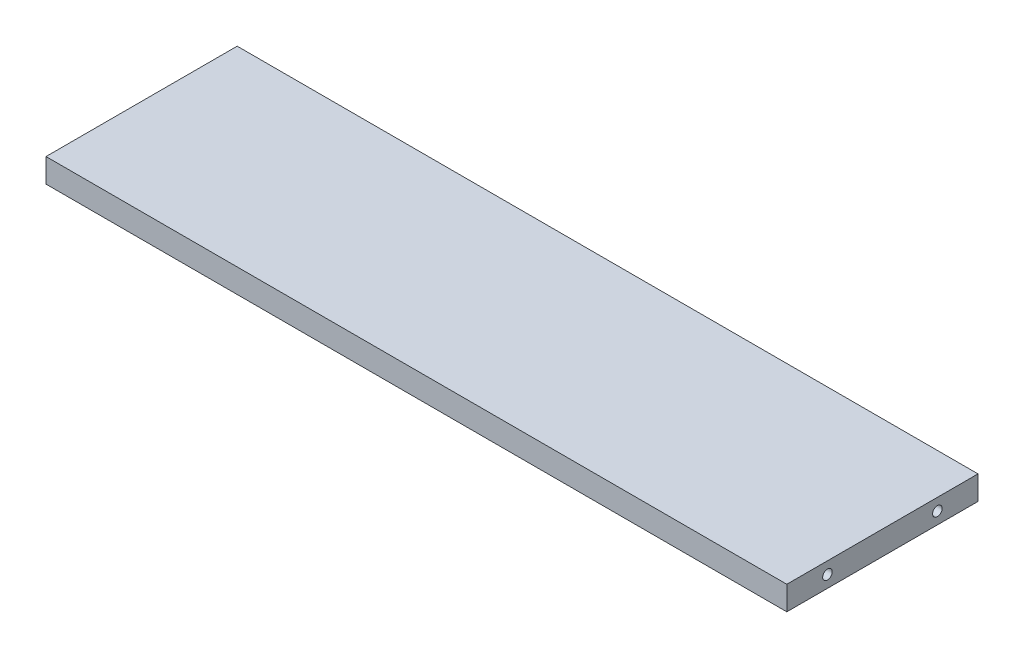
ISO-10303-21;
HEADER;
FILE_DESCRIPTION(('STEP AP214'),'2;1');
FILE_NAME('part.step','',(''),(''),'','','');
FILE_SCHEMA(('AUTOMOTIVE_DESIGN { 1 0 10303 214 1 1 1 1 }'));
ENDSEC;
DATA;
#1=APPLICATION_CONTEXT('core data for automotive mechanical design processes');
#2=APPLICATION_PROTOCOL_DEFINITION('international standard','automotive_design',2000,#1);
#3=PRODUCT_CONTEXT('',#1,'mechanical');
#4=PRODUCT('Part','Part','',(#3));
#5=PRODUCT_RELATED_PRODUCT_CATEGORY('part','',(#4));
#6=PRODUCT_DEFINITION_FORMATION('','',#4);
#7=PRODUCT_DEFINITION_CONTEXT('part definition',#1,'design');
#8=PRODUCT_DEFINITION('design','',#6,#7);
#9=PRODUCT_DEFINITION_SHAPE('','',#8);
#10=(LENGTH_UNIT() NAMED_UNIT(*) SI_UNIT(.MILLI.,.METRE.));
#11=(NAMED_UNIT(*) PLANE_ANGLE_UNIT() SI_UNIT($,.RADIAN.));
#12=(NAMED_UNIT(*) SI_UNIT($,.STERADIAN.) SOLID_ANGLE_UNIT());
#13=UNCERTAINTY_MEASURE_WITH_UNIT(LENGTH_MEASURE(1.E-05),#10,'distance_accuracy_value','');
#14=(GEOMETRIC_REPRESENTATION_CONTEXT(3) GLOBAL_UNCERTAINTY_ASSIGNED_CONTEXT((#13)) GLOBAL_UNIT_ASSIGNED_CONTEXT((#10,
#11,#12)) REPRESENTATION_CONTEXT('',''));
#15=CARTESIAN_POINT('',(0.,0.,0.));
#16=DIRECTION('',(0.,0.,1.));
#17=DIRECTION('',(1.,0.,0.));
#18=AXIS2_PLACEMENT_3D('',#15,#16,#17);
#19=CARTESIAN_POINT('',(0.,0.,-80.));
#20=DIRECTION('',(-1.,0.,0.));
#21=DIRECTION('',(0.,0.,1.));
#22=AXIS2_PLACEMENT_3D('',#19,#20,#21);
#23=PLANE('',#22);
#24=CARTESIAN_POINT('',(0.,5.,-17.));
#25=DIRECTION('',(-1.,0.,0.));
#26=DIRECTION('',(0.,0.,-1.));
#27=AXIS2_PLACEMENT_3D('',#24,#25,#26);
#28=CIRCLE('',#27,2.);
#29=CARTESIAN_POINT('',(0.,5.,-19.));
#30=VERTEX_POINT('',#29);
#31=EDGE_CURVE('E130',#30,#30,#28,.T.);
#32=ORIENTED_EDGE('',*,*,#31,.F.);
#33=EDGE_LOOP('',(#32));
#34=FACE_BOUND('',#33,.T.);
#35=CARTESIAN_POINT('',(0.,5.,-63.));
#36=DIRECTION('',(-1.,0.,0.));
#37=DIRECTION('',(0.,0.,1.));
#38=AXIS2_PLACEMENT_3D('',#35,#36,#37);
#39=CIRCLE('',#38,2.);
#40=CARTESIAN_POINT('',(0.,5.,-61.));
#41=VERTEX_POINT('',#40);
#42=EDGE_CURVE('E133',#41,#41,#39,.T.);
#43=ORIENTED_EDGE('',*,*,#42,.F.);
#44=EDGE_LOOP('',(#43));
#45=FACE_BOUND('',#44,.T.);
#46=DIRECTION('',(0.,-1.,0.));
#47=VECTOR('',#46,1.);
#48=CARTESIAN_POINT('',(0.,0.,0.));
#49=LINE('',#48,#47);
#50=CARTESIAN_POINT('',(0.,10.,0.));
#51=VERTEX_POINT('',#50);
#52=CARTESIAN_POINT('',(0.,0.,0.));
#53=VERTEX_POINT('',#52);
#54=EDGE_CURVE('E71',#51,#53,#49,.T.);
#55=ORIENTED_EDGE('',*,*,#54,.F.);
#56=DIRECTION('',(0.,0.,1.));
#57=VECTOR('',#56,1.);
#58=CARTESIAN_POINT('',(0.,10.,-80.));
#59=LINE('',#58,#57);
#60=CARTESIAN_POINT('',(0.,10.,-80.));
#61=VERTEX_POINT('',#60);
#62=EDGE_CURVE('E11',#61,#51,#59,.T.);
#63=ORIENTED_EDGE('',*,*,#62,.F.);
#64=DIRECTION('',(0.,-1.,0.));
#65=VECTOR('',#64,1.);
#66=CARTESIAN_POINT('',(0.,0.,-80.));
#67=LINE('',#66,#65);
#68=CARTESIAN_POINT('',(0.,0.,-80.));
#69=VERTEX_POINT('',#68);
#70=EDGE_CURVE('E73',#61,#69,#67,.T.);
#71=ORIENTED_EDGE('',*,*,#70,.T.);
#72=DIRECTION('',(0.,0.,1.));
#73=VECTOR('',#72,1.);
#74=CARTESIAN_POINT('',(0.,0.,-80.));
#75=LINE('',#74,#73);
#76=EDGE_CURVE('E34',#69,#53,#75,.T.);
#77=ORIENTED_EDGE('',*,*,#76,.T.);
#78=EDGE_LOOP('',(#55,#63,#71,#77));
#79=FACE_BOUND('',#78,.T.);
#80=ADVANCED_FACE('F31',(#34,#45,#79),#23,.T.);
#81=CARTESIAN_POINT('',(0.,10.,-80.));
#82=DIRECTION('',(0.,1.,0.));
#83=DIRECTION('',(0.,0.,1.));
#84=AXIS2_PLACEMENT_3D('',#81,#82,#83);
#85=PLANE('',#84);
#86=DIRECTION('',(-1.,0.,0.));
#87=VECTOR('',#86,1.);
#88=CARTESIAN_POINT('',(0.,10.,0.));
#89=LINE('',#88,#87);
#90=CARTESIAN_POINT('',(310.,10.,0.));
#91=VERTEX_POINT('',#90);
#92=EDGE_CURVE('E88',#91,#51,#89,.T.);
#93=ORIENTED_EDGE('',*,*,#92,.F.);
#94=DIRECTION('',(0.,0.,1.));
#95=VECTOR('',#94,1.);
#96=CARTESIAN_POINT('',(310.,10.,-80.));
#97=LINE('',#96,#95);
#98=CARTESIAN_POINT('',(310.,10.,-80.));
#99=VERTEX_POINT('',#98);
#100=EDGE_CURVE('E39',#99,#91,#97,.T.);
#101=ORIENTED_EDGE('',*,*,#100,.F.);
#102=DIRECTION('',(-1.,0.,0.));
#103=VECTOR('',#102,1.);
#104=CARTESIAN_POINT('',(0.,10.,-80.));
#105=LINE('',#104,#103);
#106=EDGE_CURVE('E78',#99,#61,#105,.T.);
#107=ORIENTED_EDGE('',*,*,#106,.T.);
#108=ORIENTED_EDGE('',*,*,#62,.T.);
#109=EDGE_LOOP('',(#93,#101,#107,#108));
#110=FACE_BOUND('',#109,.T.);
#111=ADVANCED_FACE('F108',(#110),#85,.T.);
#112=CARTESIAN_POINT('',(310.,0.,-80.));
#113=DIRECTION('',(1.,0.,0.));
#114=DIRECTION('',(0.,0.,-1.));
#115=AXIS2_PLACEMENT_3D('',#112,#113,#114);
#116=PLANE('',#115);
#117=CARTESIAN_POINT('',(310.,5.,-63.));
#118=DIRECTION('',(1.,0.,0.));
#119=DIRECTION('',(0.,0.,1.));
#120=AXIS2_PLACEMENT_3D('',#117,#118,#119);
#121=CIRCLE('',#120,2.);
#122=CARTESIAN_POINT('',(310.,5.,-61.));
#123=VERTEX_POINT('',#122);
#124=EDGE_CURVE('E139',#123,#123,#121,.T.);
#125=ORIENTED_EDGE('',*,*,#124,.F.);
#126=EDGE_LOOP('',(#125));
#127=FACE_BOUND('',#126,.T.);
#128=CARTESIAN_POINT('',(310.,5.,-17.));
#129=DIRECTION('',(1.,0.,0.));
#130=DIRECTION('',(0.,0.,-1.));
#131=AXIS2_PLACEMENT_3D('',#128,#129,#130);
#132=CIRCLE('',#131,2.);
#133=CARTESIAN_POINT('',(310.,5.,-19.));
#134=VERTEX_POINT('',#133);
#135=EDGE_CURVE('E92',#134,#134,#132,.T.);
#136=ORIENTED_EDGE('',*,*,#135,.F.);
#137=EDGE_LOOP('',(#136));
#138=FACE_BOUND('',#137,.T.);
#139=DIRECTION('',(0.,1.,0.));
#140=VECTOR('',#139,1.);
#141=CARTESIAN_POINT('',(310.,0.,0.));
#142=LINE('',#141,#140);
#143=CARTESIAN_POINT('',(310.,0.,0.));
#144=VERTEX_POINT('',#143);
#145=EDGE_CURVE('E85',#144,#91,#142,.T.);
#146=ORIENTED_EDGE('',*,*,#145,.F.);
#147=DIRECTION('',(0.,0.,1.));
#148=VECTOR('',#147,1.);
#149=CARTESIAN_POINT('',(310.,0.,-80.));
#150=LINE('',#149,#148);
#151=CARTESIAN_POINT('',(310.,0.,-80.));
#152=VERTEX_POINT('',#151);
#153=EDGE_CURVE('E77',#152,#144,#150,.T.);
#154=ORIENTED_EDGE('',*,*,#153,.F.);
#155=DIRECTION('',(0.,1.,0.));
#156=VECTOR('',#155,1.);
#157=CARTESIAN_POINT('',(310.,0.,-80.));
#158=LINE('',#157,#156);
#159=EDGE_CURVE('E101',#152,#99,#158,.T.);
#160=ORIENTED_EDGE('',*,*,#159,.T.);
#161=ORIENTED_EDGE('',*,*,#100,.T.);
#162=EDGE_LOOP('',(#146,#154,#160,#161));
#163=FACE_BOUND('',#162,.T.);
#164=ADVANCED_FACE('F105',(#127,#138,#163),#116,.T.);
#165=CARTESIAN_POINT('',(0.,0.,-80.));
#166=DIRECTION('',(0.,-1.,0.));
#167=DIRECTION('',(0.,0.,-1.));
#168=AXIS2_PLACEMENT_3D('',#165,#166,#167);
#169=PLANE('',#168);
#170=DIRECTION('',(1.,0.,0.));
#171=VECTOR('',#170,1.);
#172=CARTESIAN_POINT('',(0.,0.,0.));
#173=LINE('',#172,#171);
#174=EDGE_CURVE('E80',#53,#144,#173,.T.);
#175=ORIENTED_EDGE('',*,*,#174,.F.);
#176=ORIENTED_EDGE('',*,*,#76,.F.);
#177=DIRECTION('',(1.,0.,0.));
#178=VECTOR('',#177,1.);
#179=CARTESIAN_POINT('',(0.,0.,-80.));
#180=LINE('',#179,#178);
#181=EDGE_CURVE('E99',#69,#152,#180,.T.);
#182=ORIENTED_EDGE('',*,*,#181,.T.);
#183=ORIENTED_EDGE('',*,*,#153,.T.);
#184=EDGE_LOOP('',(#175,#176,#182,#183));
#185=FACE_BOUND('',#184,.T.);
#186=ADVANCED_FACE('F81',(#185),#169,.T.);
#187=CARTESIAN_POINT('',(0.,10.,-80.));
#188=DIRECTION('',(0.,0.,-1.));
#189=DIRECTION('',(-1.,0.,0.));
#190=AXIS2_PLACEMENT_3D('',#187,#188,#189);
#191=PLANE('',#190);
#192=ORIENTED_EDGE('',*,*,#70,.F.);
#193=ORIENTED_EDGE('',*,*,#106,.F.);
#194=ORIENTED_EDGE('',*,*,#159,.F.);
#195=ORIENTED_EDGE('',*,*,#181,.F.);
#196=EDGE_LOOP('',(#192,#193,#194,#195));
#197=FACE_BOUND('',#196,.T.);
#198=ADVANCED_FACE('F110',(#197),#191,.T.);
#199=CARTESIAN_POINT('',(0.,10.,0.));
#200=DIRECTION('',(0.,0.,-1.));
#201=DIRECTION('',(-1.,0.,0.));
#202=AXIS2_PLACEMENT_3D('',#199,#200,#201);
#203=PLANE('',#202);
#204=ORIENTED_EDGE('',*,*,#54,.T.);
#205=ORIENTED_EDGE('',*,*,#174,.T.);
#206=ORIENTED_EDGE('',*,*,#145,.T.);
#207=ORIENTED_EDGE('',*,*,#92,.T.);
#208=EDGE_LOOP('',(#204,#205,#206,#207));
#209=FACE_BOUND('',#208,.T.);
#210=ADVANCED_FACE('F87',(#209),#203,.F.);
#211=CARTESIAN_POINT('',(300.,5.,-17.));
#212=DIRECTION('',(1.,0.,0.));
#213=DIRECTION('',(0.,0.,-1.));
#214=AXIS2_PLACEMENT_3D('',#211,#212,#213);
#215=CYLINDRICAL_SURFACE('',#214,2.);
#216=CARTESIAN_POINT('',(300.,5.,-17.));
#217=DIRECTION('',(1.,0.,0.));
#218=DIRECTION('',(0.,0.,-1.));
#219=AXIS2_PLACEMENT_3D('',#216,#217,#218);
#220=CIRCLE('',#219,2.);
#221=CARTESIAN_POINT('',(300.,5.,-19.));
#222=VERTEX_POINT('',#221);
#223=EDGE_CURVE('E89',#222,#222,#220,.T.);
#224=ORIENTED_EDGE('',*,*,#223,.F.);
#225=EDGE_LOOP('',(#224));
#226=FACE_BOUND('',#225,.T.);
#227=ORIENTED_EDGE('',*,*,#135,.T.);
#228=EDGE_LOOP('',(#227));
#229=FACE_BOUND('',#228,.T.);
#230=ADVANCED_FACE('F117',(#226,#229),#215,.F.);
#231=CARTESIAN_POINT('',(300.,5.,-17.));
#232=DIRECTION('',(1.,0.,0.));
#233=DIRECTION('',(0.,0.,-1.));
#234=AXIS2_PLACEMENT_3D('',#231,#232,#233);
#235=PLANE('',#234);
#236=ORIENTED_EDGE('',*,*,#223,.T.);
#237=EDGE_LOOP('',(#236));
#238=FACE_BOUND('',#237,.T.);
#239=ADVANCED_FACE('F164',(#238),#235,.T.);
#240=CARTESIAN_POINT('',(300.,5.,-63.));
#241=DIRECTION('',(1.,0.,0.));
#242=DIRECTION('',(0.,0.,-1.));
#243=AXIS2_PLACEMENT_3D('',#240,#241,#242);
#244=CYLINDRICAL_SURFACE('',#243,2.);
#245=CARTESIAN_POINT('',(300.,5.,-63.));
#246=DIRECTION('',(1.,0.,0.));
#247=DIRECTION('',(0.,0.,1.));
#248=AXIS2_PLACEMENT_3D('',#245,#246,#247);
#249=CIRCLE('',#248,2.);
#250=CARTESIAN_POINT('',(300.,5.,-61.));
#251=VERTEX_POINT('',#250);
#252=EDGE_CURVE('E147',#251,#251,#249,.T.);
#253=ORIENTED_EDGE('',*,*,#252,.F.);
#254=EDGE_LOOP('',(#253));
#255=FACE_BOUND('',#254,.T.);
#256=ORIENTED_EDGE('',*,*,#124,.T.);
#257=EDGE_LOOP('',(#256));
#258=FACE_BOUND('',#257,.T.);
#259=ADVANCED_FACE('F161',(#255,#258),#244,.F.);
#260=CARTESIAN_POINT('',(300.,5.,-63.));
#261=DIRECTION('',(-1.,0.,0.));
#262=DIRECTION('',(0.,0.,1.));
#263=AXIS2_PLACEMENT_3D('',#260,#261,#262);
#264=PLANE('',#263);
#265=ORIENTED_EDGE('',*,*,#252,.T.);
#266=EDGE_LOOP('',(#265));
#267=FACE_BOUND('',#266,.T.);
#268=ADVANCED_FACE('F163',(#267),#264,.F.);
#269=CARTESIAN_POINT('',(10.,5.,-63.));
#270=DIRECTION('',(-1.,0.,0.));
#271=DIRECTION('',(0.,0.,1.));
#272=AXIS2_PLACEMENT_3D('',#269,#270,#271);
#273=CYLINDRICAL_SURFACE('',#272,2.);
#274=CARTESIAN_POINT('',(10.,5.,-63.));
#275=DIRECTION('',(-1.,0.,0.));
#276=DIRECTION('',(0.,0.,1.));
#277=AXIS2_PLACEMENT_3D('',#274,#275,#276);
#278=CIRCLE('',#277,2.);
#279=CARTESIAN_POINT('',(10.,5.,-61.));
#280=VERTEX_POINT('',#279);
#281=EDGE_CURVE('E135',#280,#280,#278,.T.);
#282=ORIENTED_EDGE('',*,*,#281,.F.);
#283=EDGE_LOOP('',(#282));
#284=FACE_BOUND('',#283,.T.);
#285=ORIENTED_EDGE('',*,*,#42,.T.);
#286=EDGE_LOOP('',(#285));
#287=FACE_BOUND('',#286,.T.);
#288=ADVANCED_FACE('F170',(#284,#287),#273,.F.);
#289=CARTESIAN_POINT('',(10.,5.,-63.));
#290=DIRECTION('',(-1.,0.,0.));
#291=DIRECTION('',(0.,0.,1.));
#292=AXIS2_PLACEMENT_3D('',#289,#290,#291);
#293=PLANE('',#292);
#294=ORIENTED_EDGE('',*,*,#281,.T.);
#295=EDGE_LOOP('',(#294));
#296=FACE_BOUND('',#295,.T.);
#297=ADVANCED_FACE('F199',(#296),#293,.T.);
#298=CARTESIAN_POINT('',(10.,5.,-17.));
#299=DIRECTION('',(-1.,0.,0.));
#300=DIRECTION('',(0.,0.,1.));
#301=AXIS2_PLACEMENT_3D('',#298,#299,#300);
#302=CYLINDRICAL_SURFACE('',#301,2.);
#303=CARTESIAN_POINT('',(10.,5.,-17.));
#304=DIRECTION('',(-1.,0.,0.));
#305=DIRECTION('',(0.,0.,-1.));
#306=AXIS2_PLACEMENT_3D('',#303,#304,#305);
#307=CIRCLE('',#306,2.);
#308=CARTESIAN_POINT('',(10.,5.,-19.));
#309=VERTEX_POINT('',#308);
#310=EDGE_CURVE('E136',#309,#309,#307,.T.);
#311=ORIENTED_EDGE('',*,*,#310,.F.);
#312=EDGE_LOOP('',(#311));
#313=FACE_BOUND('',#312,.T.);
#314=ORIENTED_EDGE('',*,*,#31,.T.);
#315=EDGE_LOOP('',(#314));
#316=FACE_BOUND('',#315,.T.);
#317=ADVANCED_FACE('F206',(#313,#316),#302,.F.);
#318=CARTESIAN_POINT('',(10.,5.,-17.));
#319=DIRECTION('',(1.,0.,0.));
#320=DIRECTION('',(0.,0.,-1.));
#321=AXIS2_PLACEMENT_3D('',#318,#319,#320);
#322=PLANE('',#321);
#323=ORIENTED_EDGE('',*,*,#310,.T.);
#324=EDGE_LOOP('',(#323));
#325=FACE_BOUND('',#324,.T.);
#326=ADVANCED_FACE('F214',(#325),#322,.F.);
#327=CLOSED_SHELL('',(#80,#111,#164,#186,#198,#210,#230,#239,#259,#268,#288,#297,#317,#326));
#328=MANIFOLD_SOLID_BREP('B2',#327);
#329=ADVANCED_BREP_SHAPE_REPRESENTATION('',(#18,#328),#14);
#330=SHAPE_DEFINITION_REPRESENTATION(#9,#329);
ENDSEC;
END-ISO-10303-21;
